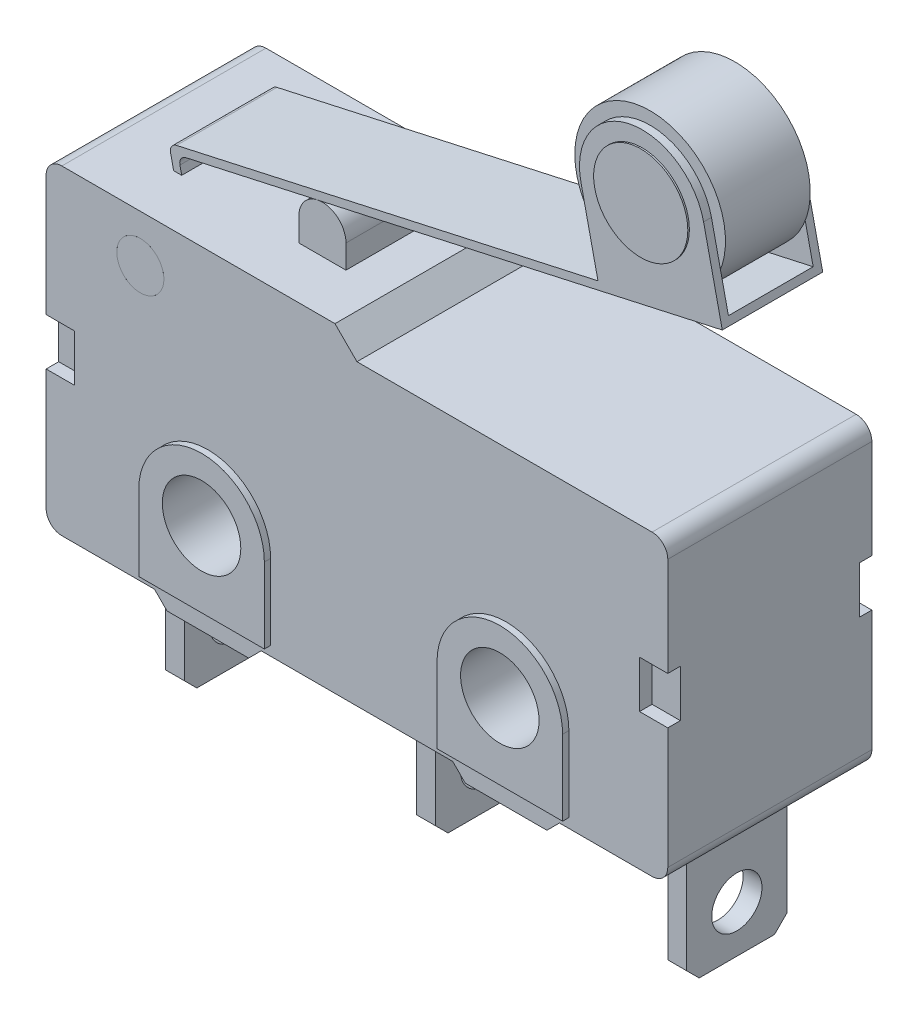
from build123d import *

# Parameters (mm, degrees)
BOSS_EXTRUDE1_DEPTH  = 3.25
SKETCH2_W            = 0.6
SKETCH2_H            = 4.1
BOSS_EXTRUDE2_DEPTH  = 1.6
SKETCH3_R            = 0.8
CUT_EXTRUDE1_DEPTH   = 22.590854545
SKETCH5_R            = 1.25
CUT_EXTRUDE2_DEPTH   = 24.201939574
BOSS_EXTRUDE3_START  = 0.2
SKETCH6_R            = 1.25
BOSS_EXTRUDE3_DEPTH  = 0.2
BOSS_EXTRUDE4_DEPTH  = 6.5
SKETCH8_W            = 0.9
SKETCH8_H            = 1.5
CUT_EXTRUDE3_DEPTH   = 0.4
SKETCH9_R            = 0.75
CUT_EXTRUDE4_DEPTH   = 24.25876179
SKETCH10_R           = 0.75
BOSS_EXTRUDE6_DEPTH  = 3.25
SKETCH11_W           = 1.5
SKETCH11_H           = 3.2
BOSS_EXTRUDE7_DEPTH  = 0.75
BOSS_EXTRUDE8_DEPTH  = 3.2
BOSS_EXTRUDE10_DEPTH = 1.6
SKETCH14_R           = 1.5
BOSS_EXTRUDE11_DEPTH = 1.6
SKETCH15_W           = 2.7
SKETCH15_H           = 5.192347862
CUT_EXTRUDE5_DEPTH   = 13.2
SKETCH16_R           = 2.4
BOSS_EXTRUDE12_DEPTH = 1.35
SKETCH17_R           = 1.5
BOSS_EXTRUDE13_DEPTH = 0.3


with BuildPart() as part:
    # Sketch1 → Boss-Extrude1 (new, symmetric)
    with BuildSketch(Plane.XY):
        with BuildLine():
            Line((9.2, 10.2), (9.9, 9.5))
            Line((9.9, 9.5), (19.3, 9.5))
            ThreePointArc((19.3, 9.5), (19.653553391, 9.353553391), (19.8, 9))
            Line((19.8, 9), (19.8, 0.5))
            ThreePointArc((19.8, 0.5), (19.653553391, 0.146446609), (19.3, 0))
            Line((19.3, 0), (0.5, 0))
            ThreePointArc((0.5, 0), (0.146446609, 0.146446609), (0, 0.5))
            Line((0, 0.5), (0, 9.7))
            ThreePointArc((0, 9.7), (0.146446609, 10.053553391), (0.5, 10.2))
            Line((0.5, 10.2), (9.2, 10.2))
        make_face()
    extrude(amount=BOSS_EXTRUDE1_DEPTH, both=True)

    # Sketch2 → Boss-Extrude2 (add, symmetric)
    with BuildSketch(Plane.XY):
        with Locations((2.45, -2.05)):
            Rectangle(SKETCH2_W, SKETCH2_H)
        with Locations((10.45, -2.05)):
            Rectangle(SKETCH2_W, SKETCH2_H)
        with Locations((18.45, -2.05)):
            Rectangle(SKETCH2_W, SKETCH2_H)
    extrude(amount=BOSS_EXTRUDE2_DEPTH, both=True)

    # Sketch3 → Cut-Extrude1 (cut, through all)
    with BuildSketch(Plane(origin=(18.75, 0, 0), x_dir=(0, 0, -1), z_dir=(1, 0, 0))):
        with Locations((0, -2.6)):
            Circle(SKETCH3_R)
        Polygon((1.2, -4.1), (1.6, -3.7), (1.6, -4.1), align=None)
        Polygon((-1.6, -4.1), (-1.2, -4.1), (-1.6, -3.7), align=None)
    extrude(amount=-CUT_EXTRUDE1_DEPTH, mode=Mode.SUBTRACT)

    # Sketch5 → Cut-Extrude2 (cut, through all)
    with BuildSketch(Plane.XY.offset(3.25)):
        with Locations((5.15, 2.7)):
            Circle(SKETCH5_R)
        with Locations((14.65, 2.7)):
            Circle(SKETCH5_R)
    extrude(amount=-CUT_EXTRUDE2_DEPTH, mode=Mode.SUBTRACT)

    # Sketch6 → Boss-Extrude3 (add)
    # profile 1 of 2: a face of its own
    with BuildSketch(Plane.XY.offset(3.25).offset(BOSS_EXTRUDE3_START)):
        with BuildLine():
            Line((3.15, 0.3), (7.15, 0.3))
            Line((7.15, 0.3), (7.15, 2.7))
            ThreePointArc((7.15, 2.7), (5.15, 4.7), (3.15, 2.7))
            Line((3.15, 2.7), (3.15, 0.3))
        make_face()
        with Locations((5.15, 2.7)):
            Circle(SKETCH6_R, mode=Mode.SUBTRACT)
    # profile 2 of 2: a face of its own
    with BuildSketch(Plane.XY.offset(3.25).offset(BOSS_EXTRUDE3_START)):
        with BuildLine():
            Line((12.65, 2.7), (12.65, 0.3))
            Line((12.65, 0.3), (16.65, 0.3))
            Line((16.65, 0.3), (16.65, 2.7))
            ThreePointArc((16.65, 2.7), (14.65, 4.7), (12.65, 2.7))
        make_face()
        with Locations((14.65, 2.7)):
            Circle(SKETCH6_R, mode=Mode.SUBTRACT)
    boss_extrude3 = extrude(amount=-BOSS_EXTRUDE3_DEPTH)

    # Mirror1: Boss-Extrude3 across plane
    add(boss_extrude3.mirror(Plane.XY))

    # Sketch7 → Boss-Extrude4 (add)
    with BuildSketch(Plane.XY.offset(3.25)):
        Polygon((3.45, 0), (3.85, -0.4), (6.45, -0.4), (6.85, 0), align=None)
        Polygon((12.95, 0), (13.35, -0.4), (15.95, -0.4), (16.35, 0), align=None)
    extrude(amount=-BOSS_EXTRUDE4_DEPTH)

    # Sketch8 → Cut-Extrude3 (cut)
    with BuildSketch(Plane.XY.offset(3.25)):
        with Locations((0.45, 5.1)):
            Rectangle(SKETCH8_W, SKETCH8_H)
        with Locations((19.35, 5.1)):
            Rectangle(SKETCH8_W, SKETCH8_H)
    cut_extrude3 = extrude(amount=-CUT_EXTRUDE3_DEPTH, mode=Mode.SUBTRACT)

    # Mirror2: Cut-Extrude3 across plane
    add(cut_extrude3.mirror(Plane.XY), mode=Mode.SUBTRACT)

    # Sketch9 → Cut-Extrude4 (cut, through all)
    with BuildSketch(Plane.XY.offset(3.25)):
        with Locations((3, 8.7)):
            Circle(SKETCH9_R)
    extrude(amount=-CUT_EXTRUDE4_DEPTH, mode=Mode.SUBTRACT)


with BuildPart() as body_2:
    # Sketch10 → Boss-Extrude6 (new, symmetric)
    with BuildSketch(Plane.XY):
        with Locations(Location((3, 8.7, 0), (0, 0, 180))):
            Circle(SKETCH10_R)
    extrude(amount=BOSS_EXTRUDE6_DEPTH, both=True)


with BuildPart() as body_3:
    # Sketch11 → Boss-Extrude7 (new body)
    with BuildSketch(Plane(origin=(0, 10.2, 0), x_dir=(1, 0, 0), z_dir=(0, 1, 0))):
        with Locations((7.15, 0)):
            Rectangle(SKETCH11_W, SKETCH11_H)
    extrude(amount=BOSS_EXTRUDE7_DEPTH)

    # Sketch12 → Boss-Extrude8 (add)
    with BuildSketch(Plane.XY.offset(1.6)):
        with BuildLine():
            Line((6.4, 10.95), (7.9, 10.95))
            ThreePointArc((7.9, 10.95), (7.15, 11.7), (6.4, 10.95))
        make_face()
    extrude(amount=-BOSS_EXTRUDE8_DEPTH)


with BuildPart() as body_4:
    # Sketch13 → Boss-Extrude10 (new, symmetric)
    with BuildSketch(Plane.XY):
        with BuildLine():
            Line((2.800710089, 10.753995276), (19.885890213, 14.54168852))
            Line((19.885890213, 14.54168852), (19.83178031, 14.785762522))
            Line((19.83178031, 14.785762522), (2.502526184, 10.943959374))
            ThreePointArc((2.502526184, 10.943959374), (2.345788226, 10.834210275), (2.312562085, 10.645775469))
            Line((2.312562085, 10.645775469), (2.411388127, 10.2))
            Line((2.411388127, 10.2), (2.667458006, 10.2))
            Line((2.667458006, 10.2), (2.61074599, 10.455811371))
            ThreePointArc((2.61074599, 10.455811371), (2.643972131, 10.644246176), (2.800710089, 10.753995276))
        make_face()
    extrude(amount=BOSS_EXTRUDE10_DEPTH, both=True)

    # Sketch14 → Boss-Extrude11 (add, symmetric)
    with BuildSketch(Plane.XY):
        with BuildLine():
            Line((19.83178031, 14.785762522), (19.290681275, 17.22650254))
            ThreePointArc((19.290681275, 17.22650254), (16.905210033, 18.746215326), (15.385497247, 16.360744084))
            Line((15.385497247, 16.360744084), (15.926596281, 13.920004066))
            Line((15.926596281, 13.920004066), (19.83178031, 14.785762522))
        make_face()
        with Locations((17.338089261, 16.793623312)):
            Circle(SKETCH14_R, mode=Mode.SUBTRACT)
    extrude(amount=BOSS_EXTRUDE11_DEPTH, both=True)

    # Sketch15 → Cut-Extrude5 (cut)
    with BuildSketch(Plane(origin=(22.027105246, 4.883291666, 0), x_dir=(0, 0, -1), z_dir=(0.9762960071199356, 0.2164396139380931, 0))):
        with Locations((0, 12.739071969)):
            Rectangle(SKETCH15_W, SKETCH15_H)
    extrude(amount=-CUT_EXTRUDE5_DEPTH, mode=Mode.SUBTRACT)


with BuildPart() as body_5:
    # Sketch16 → Boss-Extrude12 (new, symmetric)
    with BuildSketch(Plane.XY):
        with Locations(Location((17.338089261, 16.793623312, 0), (0, 0, 180))):
            Circle(SKETCH16_R)
    extrude(amount=BOSS_EXTRUDE12_DEPTH, both=True)

    # Sketch17 → Boss-Extrude13 (add)
    with BuildSketch(Plane.XY.offset(1.35)):
        with Locations((17.338089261, 16.793623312)):
            Circle(SKETCH17_R)
    boss_extrude13 = extrude(amount=BOSS_EXTRUDE13_DEPTH)

    # Mirror4: Boss-Extrude13 across plane
    add(boss_extrude13.mirror(Plane.XY))


solid = Compound([part.part, body_2.part, body_3.part, body_4.part, body_5.part])
